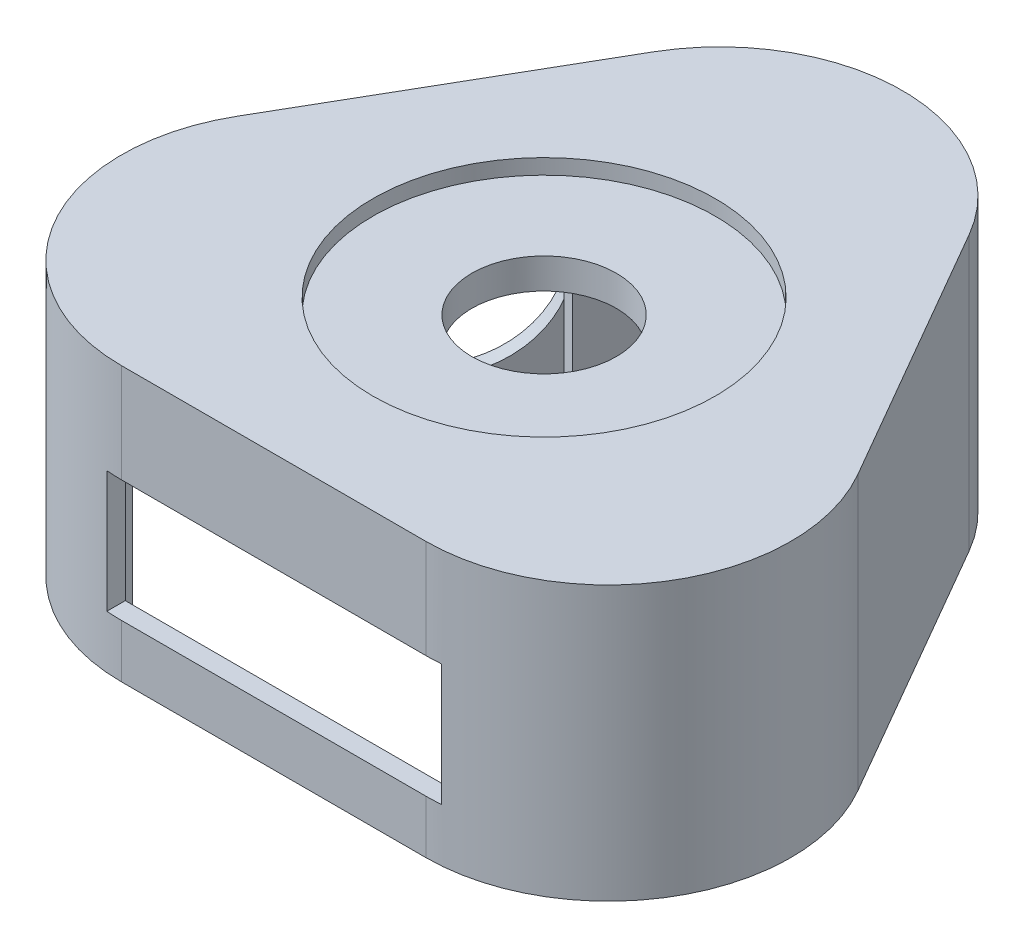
from build123d import *

# Parameters (mm, degrees)
EXTRUDE_1_DEPTH     = 18
CUT_EXTRUDE_1_DEPTH = 15
CUT_EXTRUDE_2_DEPTH = 1.5
SKETCH_4_R          = 4.75
CUT_EXTRUDE_3_DEPTH = 36.545203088
CUT_EXTRUDE_4_REACH = 51.325
SKETCH_5_R          = 5.5
SKETCH_7_R          = 11.25
CUT_EXTRUDE_6_DEPTH = 1
CUT_EXTRUDE_7_REACH = 52.154
SKETCH_8_W          = 22
SKETCH_8_H          = 8
SKETCH_9_W          = 24
SKETCH_9_H          = 11
CUT_EXTRUDE_8_DEPTH = 1.25
CHAMFER_1_SIZE      = 1.5
EXTRUDE_2_DEPTH     = 13.5


with BuildPart() as part:
    # Sketch 1 → Extrude 1 (new body)
    with BuildSketch(Plane(origin=(0, 0, 0), x_dir=(1, 0, 0), z_dir=(0, 1, 0))):
        with BuildLine():
            Line((10.392304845, 17.547005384), (20.392304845, 0.226497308))
            ThreePointArc((20.392304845, 0.226497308), (20.392304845, -11.773502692), (10, -17.773502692))
            Line((10, -17.773502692), (-10, -17.773502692))
            ThreePointArc((-10, -17.773502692), (-20.392304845, -11.773502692), (-20.392304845, 0.226497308))
            Line((-20.392304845, 0.226497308), (-10.392304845, 17.547005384))
            ThreePointArc((-10.392304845, 17.547005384), (0, 23.547005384), (10.392304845, 17.547005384))
        make_face()
    extrude(amount=EXTRUDE_1_DEPTH)

    # Sketch 2 → Cut-Extrude 1 (cut)
    with BuildSketch(Plane.XZ):
        with BuildLine():
            Line((-10, 15.273502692), (10, 15.273502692))
            ThreePointArc((10, 15.273502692), (18.227241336, 10.523502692), (18.227241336, 1.023502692))
            Line((18.227241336, 1.023502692), (8.227241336, -16.297005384))
            ThreePointArc((8.227241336, -16.297005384), (0, -21.047005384), (-8.227241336, -16.297005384))
            Line((-8.227241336, -16.297005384), (-18.227241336, 1.023502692))
            ThreePointArc((-18.227241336, 1.023502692), (-18.227241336, 10.523502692), (-10, 15.273502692))
        make_face()
    extrude(amount=-CUT_EXTRUDE_1_DEPTH, mode=Mode.SUBTRACT)

    # Sketch 3 → Cut-Extrude 2 (cut)
    with BuildSketch(Plane.XZ):
        with BuildLine():
            Line((9.309773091, -16.922005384), (19.309773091, 0.398502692))
            ThreePointArc((19.309773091, 0.398502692), (19.309773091, 11.148502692), (10, 16.523502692))
            Line((10, 16.523502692), (-10, 16.523502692))
            ThreePointArc((-10, 16.523502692), (-19.309773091, 11.148502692), (-19.309773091, 0.398502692))
            Line((-19.309773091, 0.398502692), (-9.309773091, -16.922005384))
            ThreePointArc((-9.309773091, -16.922005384), (0, -22.297005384), (9.309773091, -16.922005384))
        make_face()
    extrude(amount=-CUT_EXTRUDE_2_DEPTH, mode=Mode.SUBTRACT)

    # Sketch 4 → Cut-Extrude 3 (cut, through all)
    with BuildSketch(Plane.XZ.offset(-15)):
        with Locations(Location((0, 0, 0), (0, 0, 270))):
            Circle(SKETCH_4_R)
    extrude(amount=-CUT_EXTRUDE_3_DEPTH, mode=Mode.SUBTRACT)

    # Sketch 5 → Cut-Extrude 4 (cut, up to next)
    with BuildSketch(Plane(origin=(-15.392304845, 0, -8.886751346), x_dir=(-0.5000000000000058, 0, 0.8660254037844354), z_dir=(-0.8660254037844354, 0, -0.5000000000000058)), mode=Mode.PRIVATE) as cut_extrude_4_sk1:
        with Locations((0, 8.7)):
            Circle(SKETCH_5_R)
    cut_extrude_4_tool1 = extrude(cut_extrude_4_sk1.sketch, amount=-CUT_EXTRUDE_4_REACH, mode=Mode.PRIVATE) & part.part
    add(cut_extrude_4_tool1.solids().sort_by_distance((-15.392305, 8.7, -8.886751))[0], mode=Mode.SUBTRACT)

    # Sketch 7 → Cut-Extrude 6 (cut)
    with BuildSketch(Plane(origin=(0, 18, 0), x_dir=(1, 0, 0), z_dir=(0, 1, 0))):
        with Locations(Location((0, 0, 0), (0, 0, 270))):
            Circle(SKETCH_7_R)
    extrude(amount=-CUT_EXTRUDE_6_DEPTH, mode=Mode.SUBTRACT)

    # Sketch 8 → Cut-Extrude 7 (cut, up to next)
    with BuildSketch(Plane.XY.offset(17.773502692), mode=Mode.PRIVATE) as cut_extrude_7_sk1:
        with Locations((0, 7.5)):
            Rectangle(SKETCH_8_W, SKETCH_8_H)
    cut_extrude_7_tool1 = extrude(cut_extrude_7_sk1.sketch, amount=-CUT_EXTRUDE_7_REACH, mode=Mode.PRIVATE) & part.part
    add(cut_extrude_7_tool1.solids().sort_by_distance((0, 7.5, 17.773503))[0], mode=Mode.SUBTRACT)

    # Sketch 9 → Cut-Extrude 8 (cut, symmetric)
    with BuildSketch(Plane(origin=(0, 0, 15.273502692), x_dir=(-1, 0, 0), z_dir=(0, 0, -1))):
        with Locations((0, 7)):
            Rectangle(SKETCH_9_W, SKETCH_9_H)
    extrude(amount=CUT_EXTRUDE_8_DEPTH, both=True, mode=Mode.SUBTRACT)

    # Chamfer 1
    chamfer_1_edges = [part.edges().sort_by_distance(p)[0] for p in [
        (-12.642304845, 8.7, -13.649891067),
    ]]
    chamfer(chamfer_1_edges, length=CHAMFER_1_SIZE)

    # Sketch 10 → Extrude 2 (add)
    with BuildSketch(Plane.XZ.offset(-15)):
        Polygon((-17.227241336, -0.708548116), (-15.977241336, -2.873611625), (-13.985382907, -1.723611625), (-14.360382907, -1.074092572), (-11.329293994, 0.675907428), (-9.954293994, -1.705662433), (-8.655255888, -0.955662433), (-10.905255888, 2.941451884), align=None)
        Polygon((-9.227241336, -14.564954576), (-2.905255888, -10.914954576), (-5.155255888, -7.017840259), (-6.454293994, -7.767840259), (-5.079293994, -10.14941012), (-8.110382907, -11.89941012), (-8.485382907, -11.249891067), (-10.477241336, -12.399891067), align=None)
    extrude(amount=EXTRUDE_2_DEPTH)


solid = part.part
